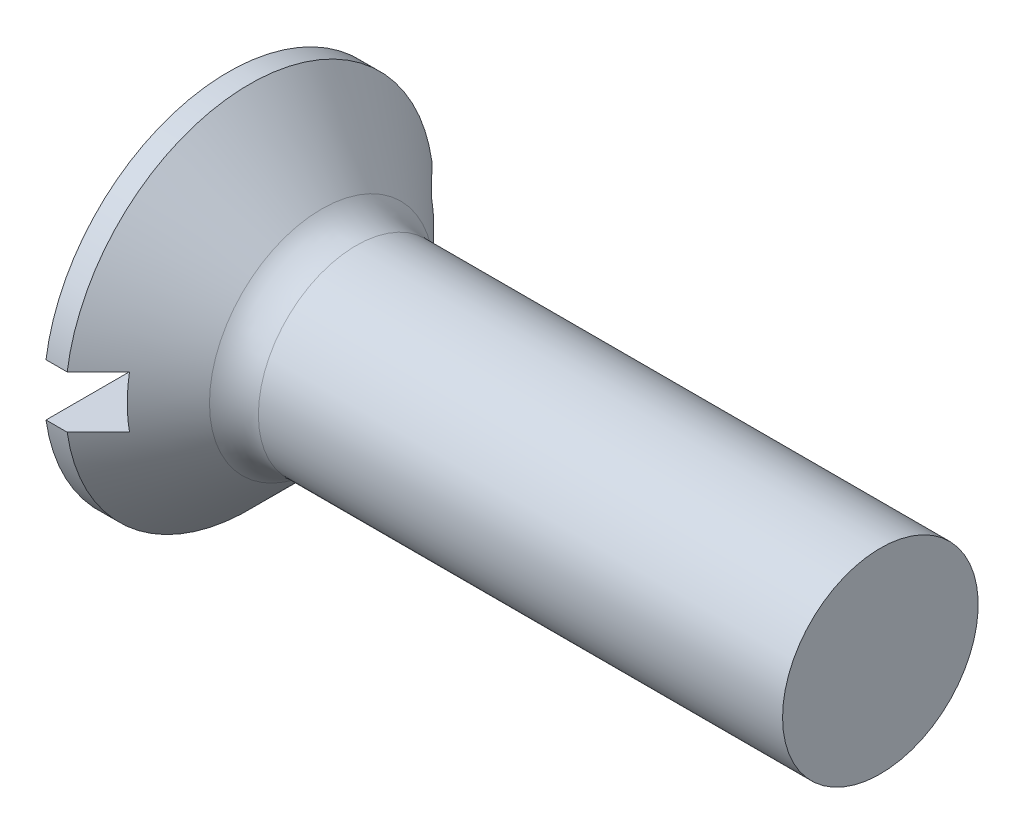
from build123d import *

# Parameters (mm, degrees)
FILLET1_R  = 1.5
SKETCH2_W  = 11.3
SKETCH2_H  = 1.6
SLOT_DEPTH = 1.6


with BuildPart() as part:
    # BodySke → Base-Revolve (revolve)
    with BuildSketch(Plane.XY, mode=Mode.PRIVATE) as base_revolve_sk:
        Polygon((0, 0), (0, 5.65), (0.65, 5.65), (3.3, 3), (20, 3), (20, 0), align=None)
    revolve(base_revolve_sk.sketch.rotate(Axis((-6.35, 0, 0), (1, 0, 0)), 90), axis=Axis((-6.35, 0, 0), (1, 0, 0)))

    # Fillet1
    fillet1_edges = [part.edges().sort_by_distance(p)[0] for p in [
        (3.3, 0, -3),
    ]]
    fillet(fillet1_edges, radius=FILLET1_R)

    # Sketch2 → Slot (cut)
    with BuildSketch(Plane.ZY):
        Rectangle(SKETCH2_W, SKETCH2_H)
    extrude(amount=-SLOT_DEPTH, mode=Mode.SUBTRACT)


solid = part.part
